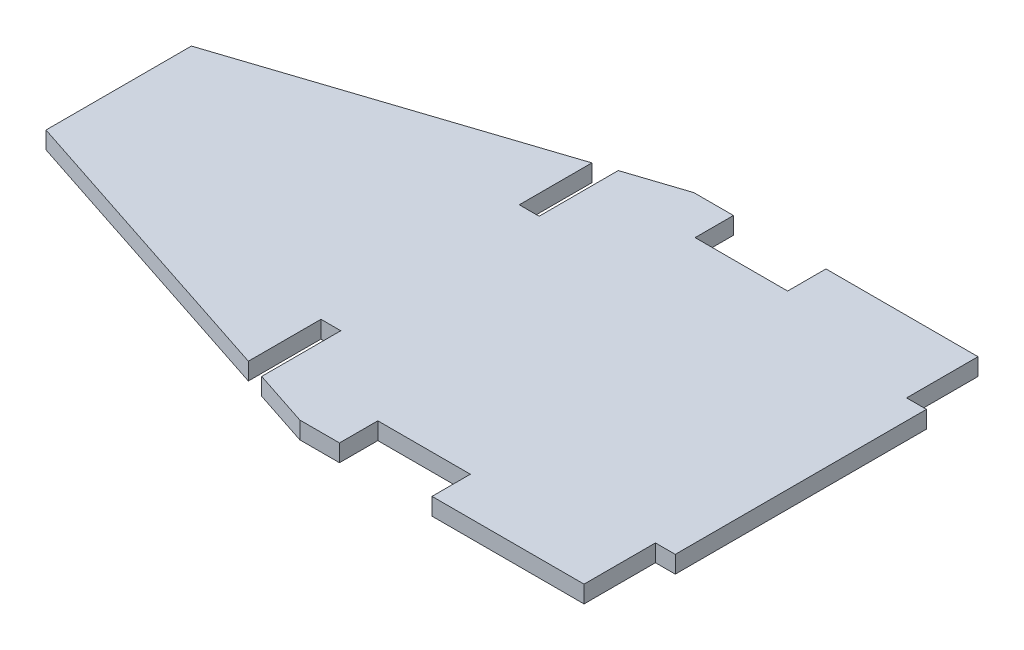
ISO-10303-21;
HEADER;
FILE_DESCRIPTION(('STEP AP214'),'2;1');
FILE_NAME('part.step','',(''),(''),'','','');
FILE_SCHEMA(('AUTOMOTIVE_DESIGN { 1 0 10303 214 1 1 1 1 }'));
ENDSEC;
DATA;
#1=APPLICATION_CONTEXT('core data for automotive mechanical design processes');
#2=APPLICATION_PROTOCOL_DEFINITION('international standard','automotive_design',2000,#1);
#3=PRODUCT_CONTEXT('',#1,'mechanical');
#4=PRODUCT('Part','Part','',(#3));
#5=PRODUCT_RELATED_PRODUCT_CATEGORY('part','',(#4));
#6=PRODUCT_DEFINITION_FORMATION('','',#4);
#7=PRODUCT_DEFINITION_CONTEXT('part definition',#1,'design');
#8=PRODUCT_DEFINITION('design','',#6,#7);
#9=PRODUCT_DEFINITION_SHAPE('','',#8);
#10=(LENGTH_UNIT() NAMED_UNIT(*) SI_UNIT(.MILLI.,.METRE.));
#11=(NAMED_UNIT(*) PLANE_ANGLE_UNIT() SI_UNIT($,.RADIAN.));
#12=(NAMED_UNIT(*) SI_UNIT($,.STERADIAN.) SOLID_ANGLE_UNIT());
#13=UNCERTAINTY_MEASURE_WITH_UNIT(LENGTH_MEASURE(1.E-05),#10,'distance_accuracy_value','');
#14=(GEOMETRIC_REPRESENTATION_CONTEXT(3) GLOBAL_UNCERTAINTY_ASSIGNED_CONTEXT((#13)) GLOBAL_UNIT_ASSIGNED_CONTEXT((#10,
#11,#12)) REPRESENTATION_CONTEXT('',''));
#15=CARTESIAN_POINT('',(0.,0.,0.));
#16=DIRECTION('',(0.,0.,1.));
#17=DIRECTION('',(1.,0.,0.));
#18=AXIS2_PLACEMENT_3D('',#15,#16,#17);
#19=CARTESIAN_POINT('',(38.6,1.3,14.9));
#20=DIRECTION('',(0.,0.,-1.));
#21=DIRECTION('',(-1.,0.,0.));
#22=AXIS2_PLACEMENT_3D('',#19,#20,#21);
#23=PLANE('',#22);
#24=DIRECTION('',(1.,0.,0.));
#25=VECTOR('',#24,1.);
#26=CARTESIAN_POINT('',(38.6,0.,14.9));
#27=LINE('',#26,#25);
#28=CARTESIAN_POINT('',(38.6,0.,14.9));
#29=VERTEX_POINT('',#28);
#30=CARTESIAN_POINT('',(50.1,0.,14.9));
#31=VERTEX_POINT('',#30);
#32=EDGE_CURVE('E235',#29,#31,#27,.T.);
#33=ORIENTED_EDGE('',*,*,#32,.T.);
#34=DIRECTION('',(0.,-1.,0.));
#35=VECTOR('',#34,1.);
#36=CARTESIAN_POINT('',(50.1,1.3,14.9));
#37=LINE('',#36,#35);
#38=CARTESIAN_POINT('',(50.1,1.3,14.9));
#39=VERTEX_POINT('',#38);
#40=EDGE_CURVE('E11',#39,#31,#37,.T.);
#41=ORIENTED_EDGE('',*,*,#40,.F.);
#42=DIRECTION('',(1.,0.,0.));
#43=VECTOR('',#42,1.);
#44=CARTESIAN_POINT('',(38.6,1.3,14.9));
#45=LINE('',#44,#43);
#46=CARTESIAN_POINT('',(38.6,1.3,14.9));
#47=VERTEX_POINT('',#46);
#48=EDGE_CURVE('E285',#47,#39,#45,.T.);
#49=ORIENTED_EDGE('',*,*,#48,.F.);
#50=DIRECTION('',(0.,-1.,0.));
#51=VECTOR('',#50,1.);
#52=CARTESIAN_POINT('',(38.6,1.3,14.9));
#53=LINE('',#52,#51);
#54=EDGE_CURVE('E231',#47,#29,#53,.T.);
#55=ORIENTED_EDGE('',*,*,#54,.T.);
#56=EDGE_LOOP('',(#33,#41,#49,#55));
#57=FACE_BOUND('',#56,.T.);
#58=ADVANCED_FACE('F31',(#57),#23,.F.);
#59=CARTESIAN_POINT('',(50.1,1.3,14.9));
#60=DIRECTION('',(-1.,0.,0.));
#61=DIRECTION('',(0.,0.,1.));
#62=AXIS2_PLACEMENT_3D('',#59,#60,#61);
#63=PLANE('',#62);
#64=DIRECTION('',(0.,0.,-1.));
#65=VECTOR('',#64,1.);
#66=CARTESIAN_POINT('',(50.1,0.,14.9));
#67=LINE('',#66,#65);
#68=CARTESIAN_POINT('',(50.1,0.,9.5));
#69=VERTEX_POINT('',#68);
#70=EDGE_CURVE('E238',#31,#69,#67,.T.);
#71=ORIENTED_EDGE('',*,*,#70,.T.);
#72=DIRECTION('',(0.,-1.,0.));
#73=VECTOR('',#72,1.);
#74=CARTESIAN_POINT('',(50.1,1.3,9.5));
#75=LINE('',#74,#73);
#76=CARTESIAN_POINT('',(50.1,1.3,9.5));
#77=VERTEX_POINT('',#76);
#78=EDGE_CURVE('E39',#77,#69,#75,.T.);
#79=ORIENTED_EDGE('',*,*,#78,.F.);
#80=DIRECTION('',(0.,0.,-1.));
#81=VECTOR('',#80,1.);
#82=CARTESIAN_POINT('',(50.1,1.3,14.9));
#83=LINE('',#82,#81);
#84=EDGE_CURVE('E144',#39,#77,#83,.T.);
#85=ORIENTED_EDGE('',*,*,#84,.F.);
#86=ORIENTED_EDGE('',*,*,#40,.T.);
#87=EDGE_LOOP('',(#71,#79,#85,#86));
#88=FACE_BOUND('',#87,.T.);
#89=ADVANCED_FACE('F433',(#88),#63,.F.);
#90=CARTESIAN_POINT('',(50.1,1.3,9.5));
#91=DIRECTION('',(0.,0.,-1.));
#92=DIRECTION('',(-1.,0.,0.));
#93=AXIS2_PLACEMENT_3D('',#90,#91,#92);
#94=PLANE('',#93);
#95=DIRECTION('',(1.,0.,0.));
#96=VECTOR('',#95,1.);
#97=CARTESIAN_POINT('',(50.1,0.,9.5));
#98=LINE('',#97,#96);
#99=CARTESIAN_POINT('',(51.6,0.,9.5));
#100=VERTEX_POINT('',#99);
#101=EDGE_CURVE('E240',#69,#100,#98,.T.);
#102=ORIENTED_EDGE('',*,*,#101,.T.);
#103=DIRECTION('',(0.,-1.,0.));
#104=VECTOR('',#103,1.);
#105=CARTESIAN_POINT('',(51.6,1.3,9.5));
#106=LINE('',#105,#104);
#107=CARTESIAN_POINT('',(51.6,1.3,9.5));
#108=VERTEX_POINT('',#107);
#109=EDGE_CURVE('E346',#108,#100,#106,.T.);
#110=ORIENTED_EDGE('',*,*,#109,.F.);
#111=DIRECTION('',(1.,0.,0.));
#112=VECTOR('',#111,1.);
#113=CARTESIAN_POINT('',(50.1,1.3,9.5));
#114=LINE('',#113,#112);
#115=EDGE_CURVE('E354',#77,#108,#114,.T.);
#116=ORIENTED_EDGE('',*,*,#115,.F.);
#117=ORIENTED_EDGE('',*,*,#78,.T.);
#118=EDGE_LOOP('',(#102,#110,#116,#117));
#119=FACE_BOUND('',#118,.T.);
#120=ADVANCED_FACE('F352',(#119),#94,.F.);
#121=CARTESIAN_POINT('',(51.6,1.3,-9.5));
#122=DIRECTION('',(-1.,0.,0.));
#123=DIRECTION('',(0.,0.,1.));
#124=AXIS2_PLACEMENT_3D('',#121,#122,#123);
#125=PLANE('',#124);
#126=DIRECTION('',(0.,0.,-1.));
#127=VECTOR('',#126,1.);
#128=CARTESIAN_POINT('',(51.6,0.,-9.5));
#129=LINE('',#128,#127);
#130=CARTESIAN_POINT('',(51.6,0.,-9.5));
#131=VERTEX_POINT('',#130);
#132=EDGE_CURVE('E242',#100,#131,#129,.T.);
#133=ORIENTED_EDGE('',*,*,#132,.T.);
#134=DIRECTION('',(0.,-1.,0.));
#135=VECTOR('',#134,1.);
#136=CARTESIAN_POINT('',(51.6,1.3,-9.5));
#137=LINE('',#136,#135);
#138=CARTESIAN_POINT('',(51.6,1.3,-9.5));
#139=VERTEX_POINT('',#138);
#140=EDGE_CURVE('E343',#139,#131,#137,.T.);
#141=ORIENTED_EDGE('',*,*,#140,.F.);
#142=DIRECTION('',(0.,0.,-1.));
#143=VECTOR('',#142,1.);
#144=CARTESIAN_POINT('',(51.6,1.3,-9.5));
#145=LINE('',#144,#143);
#146=EDGE_CURVE('E372',#108,#139,#145,.T.);
#147=ORIENTED_EDGE('',*,*,#146,.F.);
#148=ORIENTED_EDGE('',*,*,#109,.T.);
#149=EDGE_LOOP('',(#133,#141,#147,#148));
#150=FACE_BOUND('',#149,.T.);
#151=ADVANCED_FACE('F363',(#150),#125,.F.);
#152=CARTESIAN_POINT('',(50.1,1.3,-9.5));
#153=DIRECTION('',(0.,0.,1.));
#154=DIRECTION('',(1.,0.,0.));
#155=AXIS2_PLACEMENT_3D('',#152,#153,#154);
#156=PLANE('',#155);
#157=DIRECTION('',(-1.,0.,0.));
#158=VECTOR('',#157,1.);
#159=CARTESIAN_POINT('',(50.1,0.,-9.5));
#160=LINE('',#159,#158);
#161=CARTESIAN_POINT('',(50.1,0.,-9.5));
#162=VERTEX_POINT('',#161);
#163=EDGE_CURVE('E244',#131,#162,#160,.T.);
#164=ORIENTED_EDGE('',*,*,#163,.T.);
#165=DIRECTION('',(0.,-1.,0.));
#166=VECTOR('',#165,1.);
#167=CARTESIAN_POINT('',(50.1,1.3,-9.5));
#168=LINE('',#167,#166);
#169=CARTESIAN_POINT('',(50.1,1.3,-9.5));
#170=VERTEX_POINT('',#169);
#171=EDGE_CURVE('E340',#170,#162,#168,.T.);
#172=ORIENTED_EDGE('',*,*,#171,.F.);
#173=DIRECTION('',(-1.,0.,0.));
#174=VECTOR('',#173,1.);
#175=CARTESIAN_POINT('',(50.1,1.3,-9.5));
#176=LINE('',#175,#174);
#177=EDGE_CURVE('E369',#139,#170,#176,.T.);
#178=ORIENTED_EDGE('',*,*,#177,.F.);
#179=ORIENTED_EDGE('',*,*,#140,.T.);
#180=EDGE_LOOP('',(#164,#172,#178,#179));
#181=FACE_BOUND('',#180,.T.);
#182=ADVANCED_FACE('F367',(#181),#156,.F.);
#183=CARTESIAN_POINT('',(50.1,1.3,-14.9));
#184=DIRECTION('',(-1.,0.,0.));
#185=DIRECTION('',(0.,0.,1.));
#186=AXIS2_PLACEMENT_3D('',#183,#184,#185);
#187=PLANE('',#186);
#188=DIRECTION('',(0.,0.,-1.));
#189=VECTOR('',#188,1.);
#190=CARTESIAN_POINT('',(50.1,0.,-14.9));
#191=LINE('',#190,#189);
#192=CARTESIAN_POINT('',(50.1,0.,-14.9));
#193=VERTEX_POINT('',#192);
#194=EDGE_CURVE('E246',#162,#193,#191,.T.);
#195=ORIENTED_EDGE('',*,*,#194,.T.);
#196=DIRECTION('',(0.,-1.,0.));
#197=VECTOR('',#196,1.);
#198=CARTESIAN_POINT('',(50.1,1.3,-14.9));
#199=LINE('',#198,#197);
#200=CARTESIAN_POINT('',(50.1,1.3,-14.9));
#201=VERTEX_POINT('',#200);
#202=EDGE_CURVE('E337',#201,#193,#199,.T.);
#203=ORIENTED_EDGE('',*,*,#202,.F.);
#204=DIRECTION('',(0.,0.,-1.));
#205=VECTOR('',#204,1.);
#206=CARTESIAN_POINT('',(50.1,1.3,-14.9));
#207=LINE('',#206,#205);
#208=EDGE_CURVE('E371',#170,#201,#207,.T.);
#209=ORIENTED_EDGE('',*,*,#208,.F.);
#210=ORIENTED_EDGE('',*,*,#171,.T.);
#211=EDGE_LOOP('',(#195,#203,#209,#210));
#212=FACE_BOUND('',#211,.T.);
#213=ADVANCED_FACE('F446',(#212),#187,.F.);
#214=CARTESIAN_POINT('',(38.6,1.3,-14.9));
#215=DIRECTION('',(0.,0.,1.));
#216=DIRECTION('',(1.,0.,0.));
#217=AXIS2_PLACEMENT_3D('',#214,#215,#216);
#218=PLANE('',#217);
#219=DIRECTION('',(-1.,0.,0.));
#220=VECTOR('',#219,1.);
#221=CARTESIAN_POINT('',(38.6,0.,-14.9));
#222=LINE('',#221,#220);
#223=CARTESIAN_POINT('',(38.6,0.,-14.9));
#224=VERTEX_POINT('',#223);
#225=EDGE_CURVE('E248',#193,#224,#222,.T.);
#226=ORIENTED_EDGE('',*,*,#225,.T.);
#227=DIRECTION('',(0.,-1.,0.));
#228=VECTOR('',#227,1.);
#229=CARTESIAN_POINT('',(38.6,1.3,-14.9));
#230=LINE('',#229,#228);
#231=CARTESIAN_POINT('',(38.6,1.3,-14.9));
#232=VERTEX_POINT('',#231);
#233=EDGE_CURVE('E334',#232,#224,#230,.T.);
#234=ORIENTED_EDGE('',*,*,#233,.F.);
#235=DIRECTION('',(-1.,0.,0.));
#236=VECTOR('',#235,1.);
#237=CARTESIAN_POINT('',(38.6,1.3,-14.9));
#238=LINE('',#237,#236);
#239=EDGE_CURVE('E374',#201,#232,#238,.T.);
#240=ORIENTED_EDGE('',*,*,#239,.F.);
#241=ORIENTED_EDGE('',*,*,#202,.T.);
#242=EDGE_LOOP('',(#226,#234,#240,#241));
#243=FACE_BOUND('',#242,.T.);
#244=ADVANCED_FACE('F449',(#243),#218,.F.);
#245=CARTESIAN_POINT('',(38.6,1.3,-14.9));
#246=DIRECTION('',(1.,0.,0.));
#247=DIRECTION('',(0.,0.,-1.));
#248=AXIS2_PLACEMENT_3D('',#245,#246,#247);
#249=PLANE('',#248);
#250=DIRECTION('',(0.,0.,1.));
#251=VECTOR('',#250,1.);
#252=CARTESIAN_POINT('',(38.6,0.,-14.9));
#253=LINE('',#252,#251);
#254=CARTESIAN_POINT('',(38.6,0.,-12.));
#255=VERTEX_POINT('',#254);
#256=EDGE_CURVE('E250',#224,#255,#253,.T.);
#257=ORIENTED_EDGE('',*,*,#256,.T.);
#258=DIRECTION('',(0.,-1.,0.));
#259=VECTOR('',#258,1.);
#260=CARTESIAN_POINT('',(38.6,1.3,-12.));
#261=LINE('',#260,#259);
#262=CARTESIAN_POINT('',(38.6,1.3,-12.));
#263=VERTEX_POINT('',#262);
#264=EDGE_CURVE('E331',#263,#255,#261,.T.);
#265=ORIENTED_EDGE('',*,*,#264,.F.);
#266=DIRECTION('',(0.,0.,1.));
#267=VECTOR('',#266,1.);
#268=CARTESIAN_POINT('',(38.6,1.3,-14.9));
#269=LINE('',#268,#267);
#270=EDGE_CURVE('E380',#232,#263,#269,.T.);
#271=ORIENTED_EDGE('',*,*,#270,.F.);
#272=ORIENTED_EDGE('',*,*,#233,.T.);
#273=EDGE_LOOP('',(#257,#265,#271,#272));
#274=FACE_BOUND('',#273,.T.);
#275=ADVANCED_FACE('F453',(#274),#249,.F.);
#276=CARTESIAN_POINT('',(31.6,1.3,-12.));
#277=DIRECTION('',(0.,0.,1.));
#278=DIRECTION('',(1.,0.,0.));
#279=AXIS2_PLACEMENT_3D('',#276,#277,#278);
#280=PLANE('',#279);
#281=DIRECTION('',(-1.,0.,0.));
#282=VECTOR('',#281,1.);
#283=CARTESIAN_POINT('',(31.6,0.,-12.));
#284=LINE('',#283,#282);
#285=CARTESIAN_POINT('',(31.6,0.,-12.));
#286=VERTEX_POINT('',#285);
#287=EDGE_CURVE('E252',#255,#286,#284,.T.);
#288=ORIENTED_EDGE('',*,*,#287,.T.);
#289=DIRECTION('',(0.,-1.,0.));
#290=VECTOR('',#289,1.);
#291=CARTESIAN_POINT('',(31.6,1.3,-12.));
#292=LINE('',#291,#290);
#293=CARTESIAN_POINT('',(31.6,1.3,-12.));
#294=VERTEX_POINT('',#293);
#295=EDGE_CURVE('E328',#294,#286,#292,.T.);
#296=ORIENTED_EDGE('',*,*,#295,.F.);
#297=DIRECTION('',(-1.,0.,0.));
#298=VECTOR('',#297,1.);
#299=CARTESIAN_POINT('',(31.6,1.3,-12.));
#300=LINE('',#299,#298);
#301=EDGE_CURVE('E382',#263,#294,#300,.T.);
#302=ORIENTED_EDGE('',*,*,#301,.F.);
#303=ORIENTED_EDGE('',*,*,#264,.T.);
#304=EDGE_LOOP('',(#288,#296,#302,#303));
#305=FACE_BOUND('',#304,.T.);
#306=ADVANCED_FACE('F457',(#305),#280,.F.);
#307=CARTESIAN_POINT('',(31.6,1.3,-14.9));
#308=DIRECTION('',(-1.,0.,0.));
#309=DIRECTION('',(0.,0.,1.));
#310=AXIS2_PLACEMENT_3D('',#307,#308,#309);
#311=PLANE('',#310);
#312=DIRECTION('',(0.,0.,-1.));
#313=VECTOR('',#312,1.);
#314=CARTESIAN_POINT('',(31.6,0.,-14.9));
#315=LINE('',#314,#313);
#316=CARTESIAN_POINT('',(31.6,0.,-14.9));
#317=VERTEX_POINT('',#316);
#318=EDGE_CURVE('E254',#286,#317,#315,.T.);
#319=ORIENTED_EDGE('',*,*,#318,.T.);
#320=DIRECTION('',(0.,-1.,0.));
#321=VECTOR('',#320,1.);
#322=CARTESIAN_POINT('',(31.6,1.3,-14.9));
#323=LINE('',#322,#321);
#324=CARTESIAN_POINT('',(31.6,1.3,-14.9));
#325=VERTEX_POINT('',#324);
#326=EDGE_CURVE('E325',#325,#317,#323,.T.);
#327=ORIENTED_EDGE('',*,*,#326,.F.);
#328=DIRECTION('',(0.,0.,-1.));
#329=VECTOR('',#328,1.);
#330=CARTESIAN_POINT('',(31.6,1.3,-14.9));
#331=LINE('',#330,#329);
#332=EDGE_CURVE('E384',#294,#325,#331,.T.);
#333=ORIENTED_EDGE('',*,*,#332,.F.);
#334=ORIENTED_EDGE('',*,*,#295,.T.);
#335=EDGE_LOOP('',(#319,#327,#333,#334));
#336=FACE_BOUND('',#335,.T.);
#337=ADVANCED_FACE('F461',(#336),#311,.F.);
#338=CARTESIAN_POINT('',(28.6,1.3,-14.9));
#339=DIRECTION('',(0.,0.,1.));
#340=DIRECTION('',(1.,0.,0.));
#341=AXIS2_PLACEMENT_3D('',#338,#339,#340);
#342=PLANE('',#341);
#343=DIRECTION('',(-1.,0.,0.));
#344=VECTOR('',#343,1.);
#345=CARTESIAN_POINT('',(28.6,0.,-14.9));
#346=LINE('',#345,#344);
#347=CARTESIAN_POINT('',(28.6,0.,-14.9));
#348=VERTEX_POINT('',#347);
#349=EDGE_CURVE('E256',#317,#348,#346,.T.);
#350=ORIENTED_EDGE('',*,*,#349,.T.);
#351=DIRECTION('',(0.,-1.,0.));
#352=VECTOR('',#351,1.);
#353=CARTESIAN_POINT('',(28.6,1.3,-14.9));
#354=LINE('',#353,#352);
#355=CARTESIAN_POINT('',(28.6,1.3,-14.9));
#356=VERTEX_POINT('',#355);
#357=EDGE_CURVE('E322',#356,#348,#354,.T.);
#358=ORIENTED_EDGE('',*,*,#357,.F.);
#359=DIRECTION('',(-1.,0.,0.));
#360=VECTOR('',#359,1.);
#361=CARTESIAN_POINT('',(28.6,1.3,-14.9));
#362=LINE('',#361,#360);
#363=EDGE_CURVE('E386',#325,#356,#362,.T.);
#364=ORIENTED_EDGE('',*,*,#363,.F.);
#365=ORIENTED_EDGE('',*,*,#326,.T.);
#366=EDGE_LOOP('',(#350,#358,#364,#365));
#367=FACE_BOUND('',#366,.T.);
#368=ADVANCED_FACE('F465',(#367),#342,.F.);
#369=CARTESIAN_POINT('',(24.3,1.3,-13.4867132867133));
#370=DIRECTION('',(0.312238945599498,0.,0.950003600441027));
#371=DIRECTION('',(0.950003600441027,0.,-0.312238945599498));
#372=AXIS2_PLACEMENT_3D('',#369,#370,#371);
#373=PLANE('',#372);
#374=DIRECTION('',(-0.950003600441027,0.,0.312238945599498));
#375=VECTOR('',#374,1.);
#376=CARTESIAN_POINT('',(24.3,0.,-13.4867132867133));
#377=LINE('',#376,#375);
#378=CARTESIAN_POINT('',(24.3,0.,-13.4867132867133));
#379=VERTEX_POINT('',#378);
#380=EDGE_CURVE('E258',#348,#379,#377,.T.);
#381=ORIENTED_EDGE('',*,*,#380,.T.);
#382=DIRECTION('',(0.,-1.,0.));
#383=VECTOR('',#382,1.);
#384=CARTESIAN_POINT('',(24.3,1.3,-13.4867132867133));
#385=LINE('',#384,#383);
#386=CARTESIAN_POINT('',(24.3,1.3,-13.4867132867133));
#387=VERTEX_POINT('',#386);
#388=EDGE_CURVE('E319',#387,#379,#385,.T.);
#389=ORIENTED_EDGE('',*,*,#388,.F.);
#390=DIRECTION('',(-0.950003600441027,0.,0.312238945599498));
#391=VECTOR('',#390,1.);
#392=CARTESIAN_POINT('',(24.3,1.3,-13.4867132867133));
#393=LINE('',#392,#391);
#394=EDGE_CURVE('E388',#356,#387,#393,.T.);
#395=ORIENTED_EDGE('',*,*,#394,.F.);
#396=ORIENTED_EDGE('',*,*,#357,.T.);
#397=EDGE_LOOP('',(#381,#389,#395,#396));
#398=FACE_BOUND('',#397,.T.);
#399=ADVANCED_FACE('F469',(#398),#373,.F.);
#400=CARTESIAN_POINT('',(24.3,1.3,-13.4867132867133));
#401=DIRECTION('',(1.,0.,0.));
#402=DIRECTION('',(0.,0.,-1.));
#403=AXIS2_PLACEMENT_3D('',#400,#401,#402);
#404=PLANE('',#403);
#405=DIRECTION('',(0.,0.,1.));
#406=VECTOR('',#405,1.);
#407=CARTESIAN_POINT('',(24.3,0.,-13.4867132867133));
#408=LINE('',#407,#406);
#409=CARTESIAN_POINT('',(24.3,0.,-7.5));
#410=VERTEX_POINT('',#409);
#411=EDGE_CURVE('E260',#379,#410,#408,.T.);
#412=ORIENTED_EDGE('',*,*,#411,.T.);
#413=DIRECTION('',(0.,-1.,0.));
#414=VECTOR('',#413,1.);
#415=CARTESIAN_POINT('',(24.3,1.3,-7.5));
#416=LINE('',#415,#414);
#417=CARTESIAN_POINT('',(24.3,1.3,-7.5));
#418=VERTEX_POINT('',#417);
#419=EDGE_CURVE('E316',#418,#410,#416,.T.);
#420=ORIENTED_EDGE('',*,*,#419,.F.);
#421=DIRECTION('',(0.,0.,1.));
#422=VECTOR('',#421,1.);
#423=CARTESIAN_POINT('',(24.3,1.3,-13.4867132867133));
#424=LINE('',#423,#422);
#425=EDGE_CURVE('E390',#387,#418,#424,.T.);
#426=ORIENTED_EDGE('',*,*,#425,.F.);
#427=ORIENTED_EDGE('',*,*,#388,.T.);
#428=EDGE_LOOP('',(#412,#420,#426,#427));
#429=FACE_BOUND('',#428,.T.);
#430=ADVANCED_FACE('F473',(#429),#404,.F.);
#431=CARTESIAN_POINT('',(22.8,1.3,-7.5));
#432=DIRECTION('',(0.,0.,1.));
#433=DIRECTION('',(1.,0.,0.));
#434=AXIS2_PLACEMENT_3D('',#431,#432,#433);
#435=PLANE('',#434);
#436=DIRECTION('',(-1.,0.,0.));
#437=VECTOR('',#436,1.);
#438=CARTESIAN_POINT('',(22.8,0.,-7.5));
#439=LINE('',#438,#437);
#440=CARTESIAN_POINT('',(22.8,0.,-7.5));
#441=VERTEX_POINT('',#440);
#442=EDGE_CURVE('E262',#410,#441,#439,.T.);
#443=ORIENTED_EDGE('',*,*,#442,.T.);
#444=DIRECTION('',(0.,-1.,0.));
#445=VECTOR('',#444,1.);
#446=CARTESIAN_POINT('',(22.8,1.3,-7.5));
#447=LINE('',#446,#445);
#448=CARTESIAN_POINT('',(22.8,1.3,-7.5));
#449=VERTEX_POINT('',#448);
#450=EDGE_CURVE('E313',#449,#441,#447,.T.);
#451=ORIENTED_EDGE('',*,*,#450,.F.);
#452=DIRECTION('',(-1.,0.,0.));
#453=VECTOR('',#452,1.);
#454=CARTESIAN_POINT('',(22.8,1.3,-7.5));
#455=LINE('',#454,#453);
#456=EDGE_CURVE('E392',#418,#449,#455,.T.);
#457=ORIENTED_EDGE('',*,*,#456,.F.);
#458=ORIENTED_EDGE('',*,*,#419,.T.);
#459=EDGE_LOOP('',(#443,#451,#457,#458));
#460=FACE_BOUND('',#459,.T.);
#461=ADVANCED_FACE('F477',(#460),#435,.F.);
#462=CARTESIAN_POINT('',(22.8,1.3,-12.9937062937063));
#463=DIRECTION('',(-1.,0.,0.));
#464=DIRECTION('',(0.,0.,1.));
#465=AXIS2_PLACEMENT_3D('',#462,#463,#464);
#466=PLANE('',#465);
#467=DIRECTION('',(0.,0.,-1.));
#468=VECTOR('',#467,1.);
#469=CARTESIAN_POINT('',(22.8,0.,-12.9937062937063));
#470=LINE('',#469,#468);
#471=CARTESIAN_POINT('',(22.8,0.,-12.9937062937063));
#472=VERTEX_POINT('',#471);
#473=EDGE_CURVE('E264',#441,#472,#470,.T.);
#474=ORIENTED_EDGE('',*,*,#473,.T.);
#475=DIRECTION('',(0.,-1.,0.));
#476=VECTOR('',#475,1.);
#477=CARTESIAN_POINT('',(22.8,1.3,-12.9937062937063));
#478=LINE('',#477,#476);
#479=CARTESIAN_POINT('',(22.8,1.3,-12.9937062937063));
#480=VERTEX_POINT('',#479);
#481=EDGE_CURVE('E310',#480,#472,#478,.T.);
#482=ORIENTED_EDGE('',*,*,#481,.F.);
#483=DIRECTION('',(0.,0.,-1.));
#484=VECTOR('',#483,1.);
#485=CARTESIAN_POINT('',(22.8,1.3,-12.9937062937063));
#486=LINE('',#485,#484);
#487=EDGE_CURVE('E394',#449,#480,#486,.T.);
#488=ORIENTED_EDGE('',*,*,#487,.F.);
#489=ORIENTED_EDGE('',*,*,#450,.T.);
#490=EDGE_LOOP('',(#474,#482,#488,#489));
#491=FACE_BOUND('',#490,.T.);
#492=ADVANCED_FACE('F481',(#491),#466,.F.);
#493=CARTESIAN_POINT('',(0.,1.3,-5.5));
#494=DIRECTION('',(0.312238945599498,0.,0.950003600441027));
#495=DIRECTION('',(0.950003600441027,0.,-0.312238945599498));
#496=AXIS2_PLACEMENT_3D('',#493,#494,#495);
#497=PLANE('',#496);
#498=DIRECTION('',(-0.950003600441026,0.,0.312238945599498));
#499=VECTOR('',#498,1.);
#500=CARTESIAN_POINT('',(0.,0.,-5.5));
#501=LINE('',#500,#499);
#502=CARTESIAN_POINT('',(0.,0.,-5.5));
#503=VERTEX_POINT('',#502);
#504=EDGE_CURVE('E266',#472,#503,#501,.T.);
#505=ORIENTED_EDGE('',*,*,#504,.T.);
#506=DIRECTION('',(0.,-1.,0.));
#507=VECTOR('',#506,1.);
#508=CARTESIAN_POINT('',(0.,1.3,-5.5));
#509=LINE('',#508,#507);
#510=CARTESIAN_POINT('',(0.,1.3,-5.5));
#511=VERTEX_POINT('',#510);
#512=EDGE_CURVE('E307',#511,#503,#509,.T.);
#513=ORIENTED_EDGE('',*,*,#512,.F.);
#514=DIRECTION('',(-0.950003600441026,0.,0.312238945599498));
#515=VECTOR('',#514,1.);
#516=CARTESIAN_POINT('',(0.,1.3,-5.5));
#517=LINE('',#516,#515);
#518=EDGE_CURVE('E396',#480,#511,#517,.T.);
#519=ORIENTED_EDGE('',*,*,#518,.F.);
#520=ORIENTED_EDGE('',*,*,#481,.T.);
#521=EDGE_LOOP('',(#505,#513,#519,#520));
#522=FACE_BOUND('',#521,.T.);
#523=ADVANCED_FACE('F485',(#522),#497,.F.);
#524=CARTESIAN_POINT('',(0.,1.3,5.5));
#525=DIRECTION('',(1.,0.,0.));
#526=DIRECTION('',(0.,0.,-1.));
#527=AXIS2_PLACEMENT_3D('',#524,#525,#526);
#528=PLANE('',#527);
#529=DIRECTION('',(0.,0.,1.));
#530=VECTOR('',#529,1.);
#531=CARTESIAN_POINT('',(0.,0.,5.5));
#532=LINE('',#531,#530);
#533=CARTESIAN_POINT('',(0.,0.,5.5));
#534=VERTEX_POINT('',#533);
#535=EDGE_CURVE('E268',#503,#534,#532,.T.);
#536=ORIENTED_EDGE('',*,*,#535,.T.);
#537=DIRECTION('',(0.,-1.,0.));
#538=VECTOR('',#537,1.);
#539=CARTESIAN_POINT('',(0.,1.3,5.5));
#540=LINE('',#539,#538);
#541=CARTESIAN_POINT('',(0.,1.3,5.5));
#542=VERTEX_POINT('',#541);
#543=EDGE_CURVE('E304',#542,#534,#540,.T.);
#544=ORIENTED_EDGE('',*,*,#543,.F.);
#545=DIRECTION('',(0.,0.,1.));
#546=VECTOR('',#545,1.);
#547=CARTESIAN_POINT('',(0.,1.3,5.5));
#548=LINE('',#547,#546);
#549=EDGE_CURVE('E398',#511,#542,#548,.T.);
#550=ORIENTED_EDGE('',*,*,#549,.F.);
#551=ORIENTED_EDGE('',*,*,#512,.T.);
#552=EDGE_LOOP('',(#536,#544,#550,#551));
#553=FACE_BOUND('',#552,.T.);
#554=ADVANCED_FACE('F489',(#553),#528,.F.);
#555=CARTESIAN_POINT('',(0.,1.3,5.5));
#556=DIRECTION('',(0.312238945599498,0.,-0.950003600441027));
#557=DIRECTION('',(-0.950003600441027,0.,-0.312238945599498));
#558=AXIS2_PLACEMENT_3D('',#555,#556,#557);
#559=PLANE('',#558);
#560=DIRECTION('',(0.950003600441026,0.,0.312238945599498));
#561=VECTOR('',#560,1.);
#562=CARTESIAN_POINT('',(0.,0.,5.5));
#563=LINE('',#562,#561);
#564=CARTESIAN_POINT('',(22.8,0.,12.9937062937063));
#565=VERTEX_POINT('',#564);
#566=EDGE_CURVE('E270',#534,#565,#563,.T.);
#567=ORIENTED_EDGE('',*,*,#566,.T.);
#568=DIRECTION('',(0.,-1.,0.));
#569=VECTOR('',#568,1.);
#570=CARTESIAN_POINT('',(22.8,1.3,12.9937062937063));
#571=LINE('',#570,#569);
#572=CARTESIAN_POINT('',(22.8,1.3,12.9937062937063));
#573=VERTEX_POINT('',#572);
#574=EDGE_CURVE('E301',#573,#565,#571,.T.);
#575=ORIENTED_EDGE('',*,*,#574,.F.);
#576=DIRECTION('',(0.950003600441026,0.,0.312238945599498));
#577=VECTOR('',#576,1.);
#578=CARTESIAN_POINT('',(0.,1.3,5.5));
#579=LINE('',#578,#577);
#580=EDGE_CURVE('E400',#542,#573,#579,.T.);
#581=ORIENTED_EDGE('',*,*,#580,.F.);
#582=ORIENTED_EDGE('',*,*,#543,.T.);
#583=EDGE_LOOP('',(#567,#575,#581,#582));
#584=FACE_BOUND('',#583,.T.);
#585=ADVANCED_FACE('F493',(#584),#559,.F.);
#586=CARTESIAN_POINT('',(22.8,1.3,12.9937062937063));
#587=DIRECTION('',(-1.,0.,0.));
#588=DIRECTION('',(0.,0.,1.));
#589=AXIS2_PLACEMENT_3D('',#586,#587,#588);
#590=PLANE('',#589);
#591=DIRECTION('',(0.,0.,-1.));
#592=VECTOR('',#591,1.);
#593=CARTESIAN_POINT('',(22.8,0.,12.9937062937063));
#594=LINE('',#593,#592);
#595=CARTESIAN_POINT('',(22.8,0.,7.5));
#596=VERTEX_POINT('',#595);
#597=EDGE_CURVE('E272',#565,#596,#594,.T.);
#598=ORIENTED_EDGE('',*,*,#597,.T.);
#599=DIRECTION('',(0.,-1.,0.));
#600=VECTOR('',#599,1.);
#601=CARTESIAN_POINT('',(22.8,1.3,7.5));
#602=LINE('',#601,#600);
#603=CARTESIAN_POINT('',(22.8,1.3,7.5));
#604=VERTEX_POINT('',#603);
#605=EDGE_CURVE('E298',#604,#596,#602,.T.);
#606=ORIENTED_EDGE('',*,*,#605,.F.);
#607=DIRECTION('',(0.,0.,-1.));
#608=VECTOR('',#607,1.);
#609=CARTESIAN_POINT('',(22.8,1.3,12.9937062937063));
#610=LINE('',#609,#608);
#611=EDGE_CURVE('E402',#573,#604,#610,.T.);
#612=ORIENTED_EDGE('',*,*,#611,.F.);
#613=ORIENTED_EDGE('',*,*,#574,.T.);
#614=EDGE_LOOP('',(#598,#606,#612,#613));
#615=FACE_BOUND('',#614,.T.);
#616=ADVANCED_FACE('F497',(#615),#590,.F.);
#617=CARTESIAN_POINT('',(22.8,1.3,7.5));
#618=DIRECTION('',(0.,0.,-1.));
#619=DIRECTION('',(-1.,0.,0.));
#620=AXIS2_PLACEMENT_3D('',#617,#618,#619);
#621=PLANE('',#620);
#622=DIRECTION('',(1.,0.,0.));
#623=VECTOR('',#622,1.);
#624=CARTESIAN_POINT('',(22.8,0.,7.5));
#625=LINE('',#624,#623);
#626=CARTESIAN_POINT('',(24.3,0.,7.5));
#627=VERTEX_POINT('',#626);
#628=EDGE_CURVE('E274',#596,#627,#625,.T.);
#629=ORIENTED_EDGE('',*,*,#628,.T.);
#630=DIRECTION('',(0.,-1.,0.));
#631=VECTOR('',#630,1.);
#632=CARTESIAN_POINT('',(24.3,1.3,7.5));
#633=LINE('',#632,#631);
#634=CARTESIAN_POINT('',(24.3,1.3,7.5));
#635=VERTEX_POINT('',#634);
#636=EDGE_CURVE('E295',#635,#627,#633,.T.);
#637=ORIENTED_EDGE('',*,*,#636,.F.);
#638=DIRECTION('',(1.,0.,0.));
#639=VECTOR('',#638,1.);
#640=CARTESIAN_POINT('',(22.8,1.3,7.5));
#641=LINE('',#640,#639);
#642=EDGE_CURVE('E404',#604,#635,#641,.T.);
#643=ORIENTED_EDGE('',*,*,#642,.F.);
#644=ORIENTED_EDGE('',*,*,#605,.T.);
#645=EDGE_LOOP('',(#629,#637,#643,#644));
#646=FACE_BOUND('',#645,.T.);
#647=ADVANCED_FACE('F501',(#646),#621,.F.);
#648=CARTESIAN_POINT('',(24.3,1.3,13.4867132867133));
#649=DIRECTION('',(1.,0.,0.));
#650=DIRECTION('',(0.,0.,-1.));
#651=AXIS2_PLACEMENT_3D('',#648,#649,#650);
#652=PLANE('',#651);
#653=DIRECTION('',(0.,0.,1.));
#654=VECTOR('',#653,1.);
#655=CARTESIAN_POINT('',(24.3,0.,13.4867132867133));
#656=LINE('',#655,#654);
#657=CARTESIAN_POINT('',(24.3,0.,13.4867132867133));
#658=VERTEX_POINT('',#657);
#659=EDGE_CURVE('E276',#627,#658,#656,.T.);
#660=ORIENTED_EDGE('',*,*,#659,.T.);
#661=DIRECTION('',(0.,-1.,0.));
#662=VECTOR('',#661,1.);
#663=CARTESIAN_POINT('',(24.3,1.3,13.4867132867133));
#664=LINE('',#663,#662);
#665=CARTESIAN_POINT('',(24.3,1.3,13.4867132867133));
#666=VERTEX_POINT('',#665);
#667=EDGE_CURVE('E292',#666,#658,#664,.T.);
#668=ORIENTED_EDGE('',*,*,#667,.F.);
#669=DIRECTION('',(0.,0.,1.));
#670=VECTOR('',#669,1.);
#671=CARTESIAN_POINT('',(24.3,1.3,13.4867132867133));
#672=LINE('',#671,#670);
#673=EDGE_CURVE('E406',#635,#666,#672,.T.);
#674=ORIENTED_EDGE('',*,*,#673,.F.);
#675=ORIENTED_EDGE('',*,*,#636,.T.);
#676=EDGE_LOOP('',(#660,#668,#674,#675));
#677=FACE_BOUND('',#676,.T.);
#678=ADVANCED_FACE('F505',(#677),#652,.F.);
#679=CARTESIAN_POINT('',(24.3,1.3,13.4867132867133));
#680=DIRECTION('',(0.312238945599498,0.,-0.950003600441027));
#681=DIRECTION('',(-0.950003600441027,0.,-0.312238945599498));
#682=AXIS2_PLACEMENT_3D('',#679,#680,#681);
#683=PLANE('',#682);
#684=DIRECTION('',(0.950003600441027,0.,0.312238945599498));
#685=VECTOR('',#684,1.);
#686=CARTESIAN_POINT('',(24.3,0.,13.4867132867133));
#687=LINE('',#686,#685);
#688=CARTESIAN_POINT('',(28.6,0.,14.9));
#689=VERTEX_POINT('',#688);
#690=EDGE_CURVE('E278',#658,#689,#687,.T.);
#691=ORIENTED_EDGE('',*,*,#690,.T.);
#692=DIRECTION('',(0.,-1.,0.));
#693=VECTOR('',#692,1.);
#694=CARTESIAN_POINT('',(28.6,1.3,14.9));
#695=LINE('',#694,#693);
#696=CARTESIAN_POINT('',(28.6,1.3,14.9));
#697=VERTEX_POINT('',#696);
#698=EDGE_CURVE('E289',#697,#689,#695,.T.);
#699=ORIENTED_EDGE('',*,*,#698,.F.);
#700=DIRECTION('',(0.950003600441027,0.,0.312238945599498));
#701=VECTOR('',#700,1.);
#702=CARTESIAN_POINT('',(24.3,1.3,13.4867132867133));
#703=LINE('',#702,#701);
#704=EDGE_CURVE('E408',#666,#697,#703,.T.);
#705=ORIENTED_EDGE('',*,*,#704,.F.);
#706=ORIENTED_EDGE('',*,*,#667,.T.);
#707=EDGE_LOOP('',(#691,#699,#705,#706));
#708=FACE_BOUND('',#707,.T.);
#709=ADVANCED_FACE('F414',(#708),#683,.F.);
#710=CARTESIAN_POINT('',(28.6,1.3,14.9));
#711=DIRECTION('',(0.,0.,-1.));
#712=DIRECTION('',(-1.,0.,0.));
#713=AXIS2_PLACEMENT_3D('',#710,#711,#712);
#714=PLANE('',#713);
#715=DIRECTION('',(1.,0.,0.));
#716=VECTOR('',#715,1.);
#717=CARTESIAN_POINT('',(28.6,0.,14.9));
#718=LINE('',#717,#716);
#719=CARTESIAN_POINT('',(31.6,0.,14.9));
#720=VERTEX_POINT('',#719);
#721=EDGE_CURVE('E280',#689,#720,#718,.T.);
#722=ORIENTED_EDGE('',*,*,#721,.T.);
#723=DIRECTION('',(0.,-1.,0.));
#724=VECTOR('',#723,1.);
#725=CARTESIAN_POINT('',(31.6,1.3,14.9));
#726=LINE('',#725,#724);
#727=CARTESIAN_POINT('',(31.6,1.3,14.9));
#728=VERTEX_POINT('',#727);
#729=EDGE_CURVE('E226',#728,#720,#726,.T.);
#730=ORIENTED_EDGE('',*,*,#729,.F.);
#731=DIRECTION('',(1.,0.,0.));
#732=VECTOR('',#731,1.);
#733=CARTESIAN_POINT('',(28.6,1.3,14.9));
#734=LINE('',#733,#732);
#735=EDGE_CURVE('E217',#697,#728,#734,.T.);
#736=ORIENTED_EDGE('',*,*,#735,.F.);
#737=ORIENTED_EDGE('',*,*,#698,.T.);
#738=EDGE_LOOP('',(#722,#730,#736,#737));
#739=FACE_BOUND('',#738,.T.);
#740=ADVANCED_FACE('F418',(#739),#714,.F.);
#741=CARTESIAN_POINT('',(31.6,1.3,14.9));
#742=DIRECTION('',(-1.,0.,0.));
#743=DIRECTION('',(0.,0.,1.));
#744=AXIS2_PLACEMENT_3D('',#741,#742,#743);
#745=PLANE('',#744);
#746=DIRECTION('',(0.,0.,-1.));
#747=VECTOR('',#746,1.);
#748=CARTESIAN_POINT('',(31.6,0.,14.9));
#749=LINE('',#748,#747);
#750=CARTESIAN_POINT('',(31.6,0.,12.));
#751=VERTEX_POINT('',#750);
#752=EDGE_CURVE('E225',#720,#751,#749,.T.);
#753=ORIENTED_EDGE('',*,*,#752,.T.);
#754=DIRECTION('',(0.,-1.,0.));
#755=VECTOR('',#754,1.);
#756=CARTESIAN_POINT('',(31.6,1.3,12.));
#757=LINE('',#756,#755);
#758=CARTESIAN_POINT('',(31.6,1.3,12.));
#759=VERTEX_POINT('',#758);
#760=EDGE_CURVE('E222',#759,#751,#757,.T.);
#761=ORIENTED_EDGE('',*,*,#760,.F.);
#762=DIRECTION('',(0.,0.,-1.));
#763=VECTOR('',#762,1.);
#764=CARTESIAN_POINT('',(31.6,1.3,14.9));
#765=LINE('',#764,#763);
#766=EDGE_CURVE('E211',#728,#759,#765,.T.);
#767=ORIENTED_EDGE('',*,*,#766,.F.);
#768=ORIENTED_EDGE('',*,*,#729,.T.);
#769=EDGE_LOOP('',(#753,#761,#767,#768));
#770=FACE_BOUND('',#769,.T.);
#771=ADVANCED_FACE('F223',(#770),#745,.F.);
#772=CARTESIAN_POINT('',(31.6,1.3,12.));
#773=DIRECTION('',(0.,0.,-1.));
#774=DIRECTION('',(-1.,0.,0.));
#775=AXIS2_PLACEMENT_3D('',#772,#773,#774);
#776=PLANE('',#775);
#777=DIRECTION('',(1.,0.,0.));
#778=VECTOR('',#777,1.);
#779=CARTESIAN_POINT('',(31.6,0.,12.));
#780=LINE('',#779,#778);
#781=CARTESIAN_POINT('',(38.6,0.,12.));
#782=VERTEX_POINT('',#781);
#783=EDGE_CURVE('E130',#751,#782,#780,.T.);
#784=ORIENTED_EDGE('',*,*,#783,.T.);
#785=DIRECTION('',(0.,-1.,0.));
#786=VECTOR('',#785,1.);
#787=CARTESIAN_POINT('',(38.6,1.3,12.));
#788=LINE('',#787,#786);
#789=CARTESIAN_POINT('',(38.6,1.3,12.));
#790=VERTEX_POINT('',#789);
#791=EDGE_CURVE('E227',#790,#782,#788,.T.);
#792=ORIENTED_EDGE('',*,*,#791,.F.);
#793=DIRECTION('',(1.,0.,0.));
#794=VECTOR('',#793,1.);
#795=CARTESIAN_POINT('',(31.6,1.3,12.));
#796=LINE('',#795,#794);
#797=EDGE_CURVE('E215',#759,#790,#796,.T.);
#798=ORIENTED_EDGE('',*,*,#797,.F.);
#799=ORIENTED_EDGE('',*,*,#760,.T.);
#800=EDGE_LOOP('',(#784,#792,#798,#799));
#801=FACE_BOUND('',#800,.T.);
#802=ADVANCED_FACE('F229',(#801),#776,.F.);
#803=CARTESIAN_POINT('',(38.6,1.3,14.9));
#804=DIRECTION('',(1.,0.,0.));
#805=DIRECTION('',(0.,0.,-1.));
#806=AXIS2_PLACEMENT_3D('',#803,#804,#805);
#807=PLANE('',#806);
#808=DIRECTION('',(0.,0.,1.));
#809=VECTOR('',#808,1.);
#810=CARTESIAN_POINT('',(38.6,0.,14.9));
#811=LINE('',#810,#809);
#812=EDGE_CURVE('E136',#782,#29,#811,.T.);
#813=ORIENTED_EDGE('',*,*,#812,.T.);
#814=ORIENTED_EDGE('',*,*,#54,.F.);
#815=DIRECTION('',(0.,0.,1.));
#816=VECTOR('',#815,1.);
#817=CARTESIAN_POINT('',(38.6,1.3,14.9));
#818=LINE('',#817,#816);
#819=EDGE_CURVE('E47',#790,#47,#818,.T.);
#820=ORIENTED_EDGE('',*,*,#819,.F.);
#821=ORIENTED_EDGE('',*,*,#791,.T.);
#822=EDGE_LOOP('',(#813,#814,#820,#821));
#823=FACE_BOUND('',#822,.T.);
#824=ADVANCED_FACE('F422',(#823),#807,.F.);
#825=CARTESIAN_POINT('',(50.1,1.3,14.9));
#826=DIRECTION('',(0.,1.,0.));
#827=DIRECTION('',(0.,0.,1.));
#828=AXIS2_PLACEMENT_3D('',#825,#826,#827);
#829=PLANE('',#828);
#830=ORIENTED_EDGE('',*,*,#48,.T.);
#831=ORIENTED_EDGE('',*,*,#84,.T.);
#832=ORIENTED_EDGE('',*,*,#115,.T.);
#833=ORIENTED_EDGE('',*,*,#146,.T.);
#834=ORIENTED_EDGE('',*,*,#177,.T.);
#835=ORIENTED_EDGE('',*,*,#208,.T.);
#836=ORIENTED_EDGE('',*,*,#239,.T.);
#837=ORIENTED_EDGE('',*,*,#270,.T.);
#838=ORIENTED_EDGE('',*,*,#301,.T.);
#839=ORIENTED_EDGE('',*,*,#332,.T.);
#840=ORIENTED_EDGE('',*,*,#363,.T.);
#841=ORIENTED_EDGE('',*,*,#394,.T.);
#842=ORIENTED_EDGE('',*,*,#425,.T.);
#843=ORIENTED_EDGE('',*,*,#456,.T.);
#844=ORIENTED_EDGE('',*,*,#487,.T.);
#845=ORIENTED_EDGE('',*,*,#518,.T.);
#846=ORIENTED_EDGE('',*,*,#549,.T.);
#847=ORIENTED_EDGE('',*,*,#580,.T.);
#848=ORIENTED_EDGE('',*,*,#611,.T.);
#849=ORIENTED_EDGE('',*,*,#642,.T.);
#850=ORIENTED_EDGE('',*,*,#673,.T.);
#851=ORIENTED_EDGE('',*,*,#704,.T.);
#852=ORIENTED_EDGE('',*,*,#735,.T.);
#853=ORIENTED_EDGE('',*,*,#766,.T.);
#854=ORIENTED_EDGE('',*,*,#797,.T.);
#855=ORIENTED_EDGE('',*,*,#819,.T.);
#856=EDGE_LOOP('',(#830,#831,#832,#833,#834,#835,#836,#837,#838,#839,#840,#841,#842,#843,#844,
#845,#846,#847,#848,#849,#850,#851,#852,#853,#854,#855));
#857=FACE_BOUND('',#856,.T.);
#858=ADVANCED_FACE('F213',(#857),#829,.T.);
#859=CARTESIAN_POINT('',(50.1,0.,14.9));
#860=DIRECTION('',(0.,1.,0.));
#861=DIRECTION('',(0.,0.,1.));
#862=AXIS2_PLACEMENT_3D('',#859,#860,#861);
#863=PLANE('',#862);
#864=ORIENTED_EDGE('',*,*,#32,.F.);
#865=ORIENTED_EDGE('',*,*,#812,.F.);
#866=ORIENTED_EDGE('',*,*,#783,.F.);
#867=ORIENTED_EDGE('',*,*,#752,.F.);
#868=ORIENTED_EDGE('',*,*,#721,.F.);
#869=ORIENTED_EDGE('',*,*,#690,.F.);
#870=ORIENTED_EDGE('',*,*,#659,.F.);
#871=ORIENTED_EDGE('',*,*,#628,.F.);
#872=ORIENTED_EDGE('',*,*,#597,.F.);
#873=ORIENTED_EDGE('',*,*,#566,.F.);
#874=ORIENTED_EDGE('',*,*,#535,.F.);
#875=ORIENTED_EDGE('',*,*,#504,.F.);
#876=ORIENTED_EDGE('',*,*,#473,.F.);
#877=ORIENTED_EDGE('',*,*,#442,.F.);
#878=ORIENTED_EDGE('',*,*,#411,.F.);
#879=ORIENTED_EDGE('',*,*,#380,.F.);
#880=ORIENTED_EDGE('',*,*,#349,.F.);
#881=ORIENTED_EDGE('',*,*,#318,.F.);
#882=ORIENTED_EDGE('',*,*,#287,.F.);
#883=ORIENTED_EDGE('',*,*,#256,.F.);
#884=ORIENTED_EDGE('',*,*,#225,.F.);
#885=ORIENTED_EDGE('',*,*,#194,.F.);
#886=ORIENTED_EDGE('',*,*,#163,.F.);
#887=ORIENTED_EDGE('',*,*,#132,.F.);
#888=ORIENTED_EDGE('',*,*,#101,.F.);
#889=ORIENTED_EDGE('',*,*,#70,.F.);
#890=EDGE_LOOP('',(#864,#865,#866,#867,#868,#869,#870,#871,#872,#873,#874,#875,#876,#877,#878,
#879,#880,#881,#882,#883,#884,#885,#886,#887,#888,#889));
#891=FACE_BOUND('',#890,.T.);
#892=ADVANCED_FACE('F358',(#891),#863,.F.);
#893=CLOSED_SHELL('',(#58,#89,#120,#151,#182,#213,#244,#275,#306,#337,#368,#399,#430,#461,#492,
#523,#554,#585,#616,#647,#678,#709,#740,#771,#802,#824,#858,#892));
#894=MANIFOLD_SOLID_BREP('B2',#893);
#895=ADVANCED_BREP_SHAPE_REPRESENTATION('',(#18,#894),#14);
#896=SHAPE_DEFINITION_REPRESENTATION(#9,#895);
ENDSEC;
END-ISO-10303-21;
